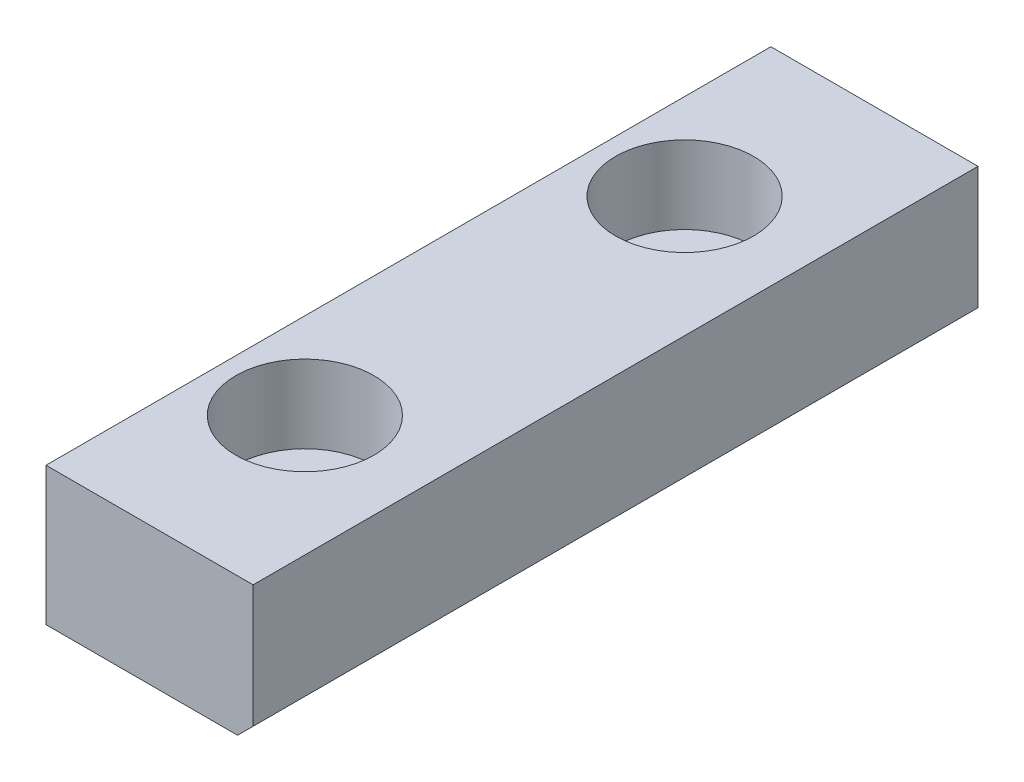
from build123d import *

# Parameters (mm, degrees)
EXTRUDE_1_DEPTH     = 42
SKETCH_2_R          = 2.25
CUT_EXTRUDE_1_DEPTH = 42
SKETCH_3_R          = 4
CUT_EXTRUDE_2_DEPTH = 4.5


with BuildPart() as part:
    # Sketch 1 → Extrude 1 (new body)
    with BuildSketch(Plane.XY):
        Polygon((0, 0), (11.1, 0), (12, 0.9), (12, 8), (0, 8), align=None)
    extrude(amount=EXTRUDE_1_DEPTH)

    # Sketch 2 → Cut-Extrude 1 (cut)
    with BuildSketch(Plane(origin=(0, 8, 0), x_dir=(1, 0, 0), z_dir=(0, 1, 0))):
        with Locations(Location((5, -10, 0), (0, 0, 270))):
            Circle(SKETCH_2_R)
        with Locations(Location((5, -32, 0), (0, 0, 270))):
            Circle(SKETCH_2_R)
    extrude(amount=-CUT_EXTRUDE_1_DEPTH, mode=Mode.SUBTRACT)

    # Sketch 3 → Cut-Extrude 2 (cut)
    with BuildSketch(Plane(origin=(0, 8, 0), x_dir=(1, 0, 0), z_dir=(0, 1, 0))):
        with Locations(Location((5, -10, 0), (0, 0, 270))):
            Circle(SKETCH_3_R)
        with Locations(Location((5, -32, 0), (0, 0, 270))):
            Circle(SKETCH_3_R)
    extrude(amount=-CUT_EXTRUDE_2_DEPTH, mode=Mode.SUBTRACT)


solid = part.part
